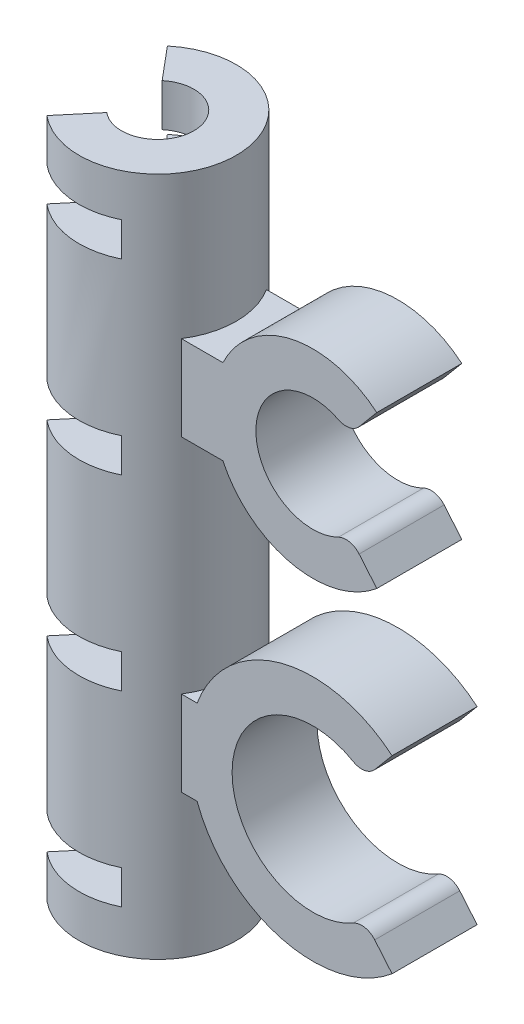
from build123d import *

# Parameters (mm, degrees)
BOSS_EXTRUDE1_DEPTH     = 40
BOSS_EXTRUDE2_DEPTH     = 5
CUT_EXTRUDE1_DEPTH      = 53.406056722
CUT_EXTRUDE1_DEPTH_BACK = 53.406056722
SKETCH5_W               = 10
SKETCH5_H               = 4
FILLET1_R               = 2


with BuildPart() as part:
    # Sketch1 → Boss-Extrude1 (new, symmetric)
    with BuildSketch(Plane(origin=(0, 0, 0), x_dir=(1, 0, 0), z_dir=(0, 1, 0))):
        with BuildLine():
            Line((-2.731847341, 3.255688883), (-5.94578539, 7.085911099))
            ThreePointArc((-5.94578539, 7.085911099), (9.25, 0), (-5.94578539, -7.085911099))
            Line((-5.94578539, -7.085911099), (-2.731847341, -3.255688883))
            ThreePointArc((-2.731847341, -3.255688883), (4.25, 0), (-2.731847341, 3.255688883))
        make_face()
    extrude(amount=BOSS_EXTRUDE1_DEPTH, both=True)

    # Sketch2 → Boss-Extrude2 (add, symmetric)
    with BuildSketch(Plane.XY):
        with BuildLine():
            ThreePointArc((12.672193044, 13.1), (11.55, 18.1), (12.672193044, 23.1))
            Line((12.672193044, 23.1), (4.25, 23.1))
            Line((4.25, 23.1), (4.25, 13.1))
            Line((4.25, 13.1), (12.672193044, 13.1))
        make_face()
        with BuildLine():
            Line((30.770615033, 27.062719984), (27.556676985, 23.232497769))
            ThreePointArc((27.556676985, 23.232497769), (16.55, 18.1), (27.556676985, 12.967502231))
            Line((27.556676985, 12.967502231), (30.770615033, 9.137280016))
            ThreePointArc((30.770615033, 9.137280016), (11.55, 18.1), (30.770615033, 27.062719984))
        make_face()
        with BuildLine():
            Line((4.25, -23.1), (9.639342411, -23.1))
            ThreePointArc((9.639342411, -23.1), (8.75, -18.1), (9.639342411, -13.1))
            Line((9.639342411, -13.1), (4.25, -13.1))
            Line((4.25, -13.1), (4.25, -23.1))
        make_face()
        with BuildLine():
            Line((32.57042034, -6.992355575), (29.356482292, -10.82257779))
            ThreePointArc((29.356482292, -10.82257779), (13.75, -18.1), (29.356482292, -25.37742221))
            Line((29.356482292, -25.37742221), (32.57042034, -29.207644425))
            ThreePointArc((32.57042034, -29.207644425), (8.75, -18.1), (32.57042034, -6.992355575))
        make_face()
    extrude(amount=BOSS_EXTRUDE2_DEPTH, both=True)

    # Sketch5 → Cut-Extrude1 (cut, two sides: drawn at the far end of the back side and taken through both)
    with BuildSketch(Plane.XY.offset(-CUT_EXTRUDE1_DEPTH_BACK)):
        with Locations((-0.94578539, 33)):
            Rectangle(SKETCH5_W, SKETCH5_H)
        with Locations((-0.94578539, 11)):
            Rectangle(SKETCH5_W, SKETCH5_H)
        with Locations((-0.94578539, -11)):
            Rectangle(SKETCH5_W, SKETCH5_H)
        with Locations((-0.94578539, -33)):
            Rectangle(SKETCH5_W, SKETCH5_H)
    extrude(amount=CUT_EXTRUDE1_DEPTH + CUT_EXTRUDE1_DEPTH_BACK, mode=Mode.SUBTRACT)

    # Fillet1
    fillet1_edges = [part.edges().sort_by_distance(p)[0] for p in [
        (27.556676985, 12.967502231, 0),
        (27.556676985, 23.232497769, 0),
        (29.356482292, -25.37742221, 0),
        (29.356482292, -10.82257779, 0),
    ]]
    fillet(fillet1_edges, radius=FILLET1_R)


solid = part.part
